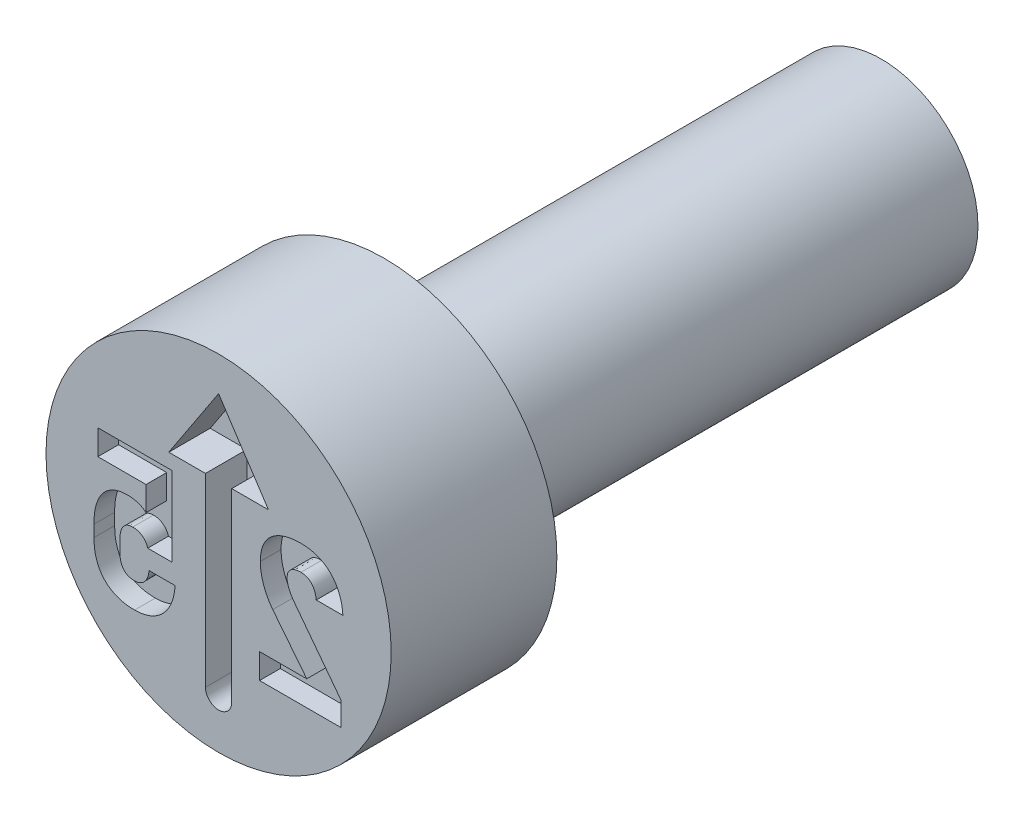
from build123d import *

# Parameters (mm, degrees)
CUT_EXTRUDE4_DEPTH = 0.3
CUT_EXTRUDE5_DEPTH = 0.15


with BuildPart() as part:
    # Sketch2 → Revolve1 (revolve)
    with BuildSketch(Plane(origin=(0, 0, 0), x_dir=(0, 0, -1), z_dir=(1, 0, 0)), mode=Mode.PRIVATE) as revolve1_sk:
        Polygon((0, 1.25), (0, 0), (4.8, 0), (4.8, 0.7), (1.2, 0.7), (1.2, 1.25), align=None)
    revolve(revolve1_sk.sketch.rotate(Axis((0, 0, -0.403888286), (0, 0, -1)), 90), axis=Axis((0, 0, -0.403888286), (0, 0, -1)))

    # Sketch3 → Cut-Extrude4 (cut)
    with BuildSketch(Plane.XY):
        with BuildLine():
            Line((0.095236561, 0.453175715), (0.095236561, -0.888080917))
            ThreePointArc((0.095236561, -0.888080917), (0, -0.983317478), (-0.095236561, -0.888080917))
            Line((-0.095236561, -0.888080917), (-0.095236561, 0.453175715))
            Line((-0.095236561, 0.453175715), (-0.360958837, 0.453175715))
            Line((-0.360958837, 0.453175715), (0, 1.001057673))
            Line((0, 1.001057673), (0.360958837, 0.453175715))
            Line((0.360958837, 0.453175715), (0.095236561, 0.453175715))
        make_face()
    extrude(amount=-CUT_EXTRUDE4_DEPTH, mode=Mode.SUBTRACT)

    # Sketch4 → Cut-Extrude5 (cut)
    with BuildSketch(Plane.XY):
        with BuildLine():
            Line((0.88810762, -0.48003872), (0.544924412, -0.028846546))
            add(Edge.make_bspline(
                [(0.544924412, -0.028846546), (0.537726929, -0.018860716), (0.523675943, 0.000633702), (0.511104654, 0.027521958), (0.503118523, 0.048605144), (0.499426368, 0.063898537), (0.496693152, 0.078522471), (0.49637453, 0.088117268), (0.496218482, 0.092816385)],
                knots=[0, 0, 0, 0, 1.660423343, 3.241491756, 3.993801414, 4.704207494, 5.365376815, 6, 6, 6, 6], degree=3))
            Line((0.496218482, 0.092816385), (0.496218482, 0.094242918))
            add(Edge.make_bspline(
                [(0.496218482, 0.094242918), (0.496491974, 0.100664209), (0.497013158, 0.112901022), (0.502044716, 0.130116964), (0.510364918, 0.14500405), (0.522019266, 0.157483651), (0.536843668, 0.1670748), (0.554329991, 0.174081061), (0.574571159, 0.178045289), (0.588925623, 0.178550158), (0.59648341, 0.178815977)],
                knots=[0, 0, 0, 0, 1.033361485, 1.969238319, 2.861873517, 3.760870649, 4.693536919, 5.686153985, 6.781734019, 8, 8, 8, 8], degree=3))
            add(Edge.make_bspline(
                [(0.59648341, 0.178815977), (0.603925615, 0.178501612), (0.618368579, 0.177891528), (0.638913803, 0.172078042), (0.65716482, 0.162208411), (0.672964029, 0.148568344), (0.686220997, 0.131409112), (0.695992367, 0.110737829), (0.703861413, 0.087244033), (0.706144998, 0.070192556), (0.707345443, 0.061228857)],
                knots=[0, 0, 0, 0, 0.993701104, 1.928459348, 2.826878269, 3.748294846, 4.700551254, 5.70417143, 6.793118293, 8, 8, 8, 8], degree=3))
            Line((0.707345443, 0.061228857), (0.900538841, 0.060413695))
            add(Edge.make_bspline(
                [(0.900538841, 0.060413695), (0.899154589, 0.076283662), (0.896457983, 0.105611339), (0.887288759, 0.147786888), (0.873743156, 0.186594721), (0.856436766, 0.222141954), (0.835216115, 0.253979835), (0.810593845, 0.282099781), (0.782297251, 0.305955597), (0.750816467, 0.325778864), (0.716288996, 0.341292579), (0.67913709, 0.352596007), (0.639304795, 0.359112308), (0.611927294, 0.359959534), (0.597909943, 0.360393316)],
                knots=[0, 0, 0, 0, 1.143950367, 2.228484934, 3.258162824, 4.249580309, 5.213917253, 6.146796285, 7.070112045, 8.006232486, 8.954636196, 9.927630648, 10.9389416, 12, 12, 12, 12], degree=3))
            add(Edge.make_bspline(
                [(0.597909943, 0.360393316), (0.582878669, 0.360079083), (0.553786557, 0.359470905), (0.51189587, 0.353745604), (0.473376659, 0.344218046), (0.438325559, 0.330832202), (0.406972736, 0.313625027), (0.379173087, 0.293200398), (0.355711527, 0.268765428), (0.336196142, 0.241006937), (0.320812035, 0.210032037), (0.310038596, 0.175867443), (0.303440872, 0.138787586), (0.302628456, 0.113019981), (0.302209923, 0.099745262)],
                knots=[0, 0, 0, 0, 1.208591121, 2.339154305, 3.392741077, 4.394302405, 5.348037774, 6.261656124, 7.158186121, 8.060194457, 8.981460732, 9.928425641, 10.932785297, 12, 12, 12, 12], degree=3))
            add(Edge.make_bspline(
                [(0.302209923, 0.099745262), (0.30247119, 0.08757143), (0.302994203, 0.064833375), (0.307658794, 0.030863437), (0.315286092, -0.002910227), (0.32563531, -0.03636927), (0.338558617, -0.068954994), (0.353981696, -0.100148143), (0.371590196, -0.129869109), (0.385387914, -0.148249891), (0.392285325, -0.157438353)],
                knots=[0, 0, 0, 0, 0.985191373, 1.972179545, 2.968870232, 3.986806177, 5.007996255, 6.007036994, 7.003727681, 8, 8, 8, 8], degree=3))
            Line((0.392285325, -0.157438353), (0.638464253, -0.468422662))
            Line((0.638464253, -0.468422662), (0.296707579, -0.468422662))
            Line((0.296707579, -0.468422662), (0.296707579, -0.65))
            Line((0.296707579, -0.65), (0.88810762, -0.65))
            Line((0.88810762, -0.65), (0.88810762, -0.48003872))
        make_face()
        with BuildLine():
            add(Edge.make_bspline(
                [(-0.608203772, -0.660393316), (-0.595060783, -0.659992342), (-0.56934221, -0.659207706), (-0.531853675, -0.652163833), (-0.496313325, -0.641255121), (-0.462985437, -0.6256931), (-0.432232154, -0.605922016), (-0.404733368, -0.581745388), (-0.380236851, -0.553796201), (-0.359233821, -0.521829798), (-0.341936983, -0.486188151), (-0.328471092, -0.447291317), (-0.319222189, -0.405209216), (-0.316533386, -0.376013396), (-0.315153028, -0.361025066)],
                knots=[0, 0, 0, 0, 1.013165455, 1.982590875, 2.932437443, 3.87502652, 4.811241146, 5.743574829, 6.690699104, 7.67044025, 8.68537997, 9.739549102, 10.839546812, 12, 12, 12, 12], degree=3))
            Line((-0.315153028, -0.361025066), (-0.503659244, -0.360413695))
            add(Edge.make_bspline(
                [(-0.503659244, -0.360413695), (-0.504735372, -0.369777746), (-0.506786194, -0.386458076), (-0.514181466, -0.409605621), (-0.523836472, -0.429952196), (-0.536589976, -0.447024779), (-0.551734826, -0.460885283), (-0.569680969, -0.470285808), (-0.589515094, -0.476558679), (-0.603601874, -0.477107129), (-0.610853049, -0.477389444)],
                knots=[0, 0, 0, 0, 1.202223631, 2.291125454, 3.30376979, 4.265156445, 5.185306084, 6.082185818, 7.012804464, 8, 8, 8, 8], degree=3))
            add(Edge.make_bspline(
                [(-0.610853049, -0.477389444), (-0.618712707, -0.47704704), (-0.633746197, -0.476392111), (-0.654818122, -0.470071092), (-0.673162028, -0.459951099), (-0.688314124, -0.445388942), (-0.700401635, -0.427244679), (-0.70895787, -0.405516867), (-0.714025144, -0.380550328), (-0.7145238, -0.362816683), (-0.714786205, -0.353484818)],
                knots=[0, 0, 0, 0, 1.026088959, 1.96264217, 2.850204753, 3.743092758, 4.68486217, 5.681854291, 6.780136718, 8, 8, 8, 8], degree=3))
            Line((-0.714786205, -0.353484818), (-0.714786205, -0.269726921))
            add(Edge.make_bspline(
                [(-0.714786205, -0.269726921), (-0.714584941, -0.260395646), (-0.714202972, -0.242686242), (-0.709451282, -0.217913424), (-0.702063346, -0.196299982), (-0.691152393, -0.178357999), (-0.677588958, -0.163876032), (-0.661175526, -0.153590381), (-0.642241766, -0.14751555), (-0.628832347, -0.146803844), (-0.621857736, -0.146433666)],
                knots=[0, 0, 0, 0, 1.281587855, 2.432267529, 3.454745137, 4.406485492, 5.298532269, 6.159104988, 7.042499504, 8, 8, 8, 8], degree=3))
            add(Edge.make_bspline(
                [(-0.621857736, -0.146433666), (-0.615315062, -0.146633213), (-0.602648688, -0.147019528), (-0.584411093, -0.151019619), (-0.567648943, -0.157564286), (-0.552552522, -0.166817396), (-0.539219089, -0.178158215), (-0.528241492, -0.191861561), (-0.519039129, -0.207345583), (-0.515199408, -0.21895888), (-0.513237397, -0.22489301)],
                knots=[0, 0, 0, 0, 1.085085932, 2.100686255, 3.083167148, 4.060192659, 5.028057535, 5.974180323, 6.964852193, 8, 8, 8, 8], degree=3))
            Line((-0.513237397, -0.22489301), (-0.337162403, -0.22489301))
            Line((-0.337162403, -0.22489301), (-0.337162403, 0.35))
            Line((-0.337162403, 0.35), (-0.874354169, 0.35))
            Line((-0.874354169, 0.35), (-0.874354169, 0.168422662))
            Line((-0.874354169, 0.168422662), (-0.525668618, 0.168422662))
            Line((-0.525668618, 0.168422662), (-0.525668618, -0.008263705))
            add(Edge.make_bspline(
                [(-0.525668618, -0.008263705), (-0.529462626, -0.00490421), (-0.537267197, 0.002006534), (-0.550911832, 0.010781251), (-0.566517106, 0.018233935), (-0.589544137, 0.026817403), (-0.619835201, 0.034450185), (-0.644702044, 0.035735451), (-0.656909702, 0.036366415)],
                knots=[0, 0, 0, 0, 0.643749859, 1.324243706, 2.054464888, 2.839075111, 4.448235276, 6, 6, 6, 6], degree=3))
            add(Edge.make_bspline(
                [(-0.656909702, 0.036366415), (-0.669442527, 0.035969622), (-0.693749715, 0.03520005), (-0.728810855, 0.028277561), (-0.761122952, 0.017187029), (-0.790419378, 0.001208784), (-0.816733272, -0.018817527), (-0.839588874, -0.043288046), (-0.859128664, -0.071803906), (-0.875120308, -0.104384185), (-0.887706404, -0.140743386), (-0.896848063, -0.180627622), (-0.902057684, -0.224075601), (-0.902737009, -0.254156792), (-0.90308863, -0.269726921)],
                knots=[0, 0, 0, 0, 1.012739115, 1.964189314, 2.878178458, 3.765675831, 4.65138573, 5.541464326, 6.461953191, 7.437418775, 8.467828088, 9.567356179, 10.740855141, 12, 12, 12, 12], degree=3))
            Line((-0.90308863, -0.269726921), (-0.90308863, -0.353484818))
            add(Edge.make_bspline(
                [(-0.90308863, -0.353484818), (-0.902642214, -0.369059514), (-0.901778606, -0.39918926), (-0.895602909, -0.442759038), (-0.884469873, -0.482725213), (-0.869553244, -0.519346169), (-0.850075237, -0.551894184), (-0.826751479, -0.580644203), (-0.799156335, -0.604932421), (-0.767941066, -0.62537301), (-0.732808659, -0.641049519), (-0.694320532, -0.65243799), (-0.652324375, -0.659211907), (-0.623241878, -0.659990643), (-0.608203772, -0.660393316)],
                knots=[0, 0, 0, 0, 1.159103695, 2.242322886, 3.265299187, 4.239894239, 5.17631577, 6.078070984, 6.98412447, 7.901225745, 8.844758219, 9.836512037, 10.881294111, 12, 12, 12, 12], degree=3))
        make_face()
    extrude(amount=-CUT_EXTRUDE5_DEPTH, mode=Mode.SUBTRACT)


solid = part.part
